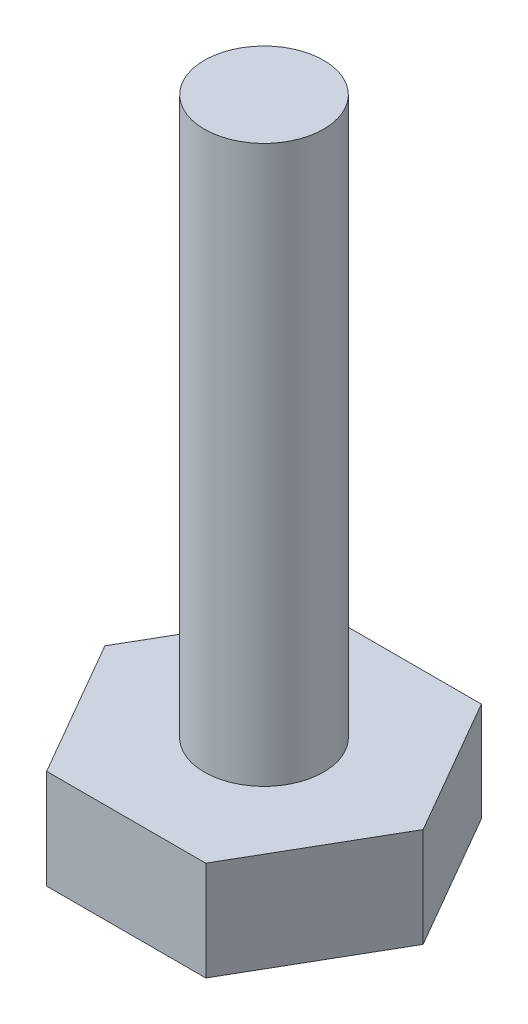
from build123d import *

# Parameters (mm, degrees)
BOSS_EXTRUDE1_DEPTH = 12.5
SKETCH2_R           = 7.5
BOSS_EXTRUDE2_DEPTH = 70


with BuildPart() as part:
    # Sketch1 → Boss-Extrude1 (new body)
    with BuildSketch(Plane(origin=(0, 0, 0), x_dir=(1, 0, 0), z_dir=(0, 1, 0))):
        Polygon((20, 0), (10, 17.320508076), (-10, 17.320508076), (-20, 0), (-10, -17.320508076), (10, -17.320508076), align=None)
    extrude(amount=BOSS_EXTRUDE1_DEPTH)

    # Sketch2 → Boss-Extrude2 (add)
    with BuildSketch(Plane(origin=(0, 12.5, 0), x_dir=(1, 0, 0), z_dir=(0, 1, 0))):
        with Locations(Location((0, 0, 0), (0, 0, 270))):
            Circle(SKETCH2_R)
    extrude(amount=BOSS_EXTRUDE2_DEPTH)


solid = part.part
